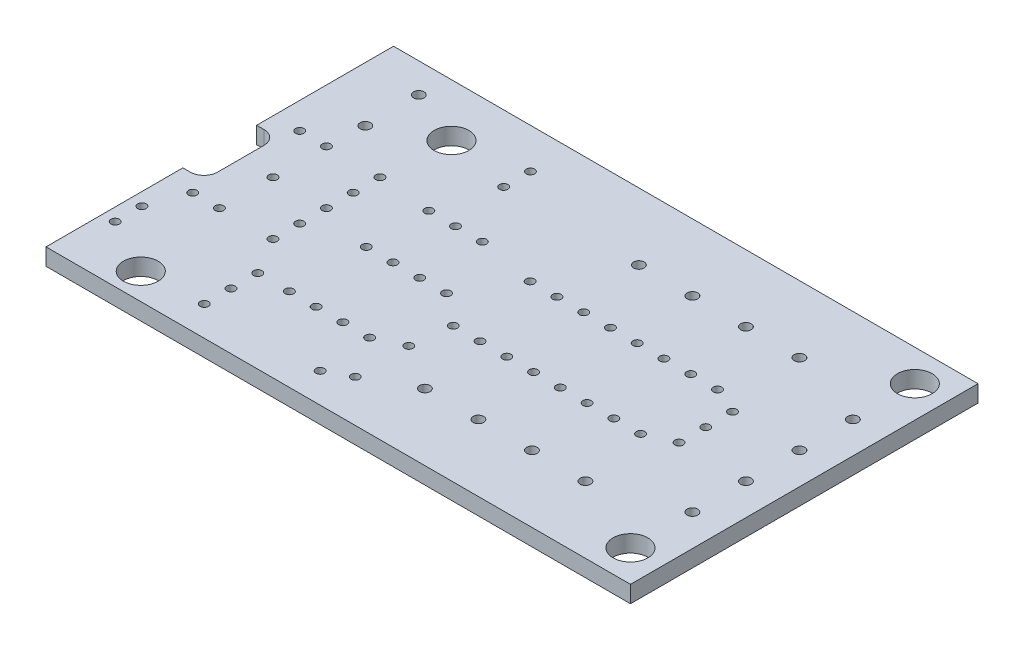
from build123d import *

# Parameters (mm, degrees)
ESQUISSE1_R      = 1.65
ESQUISSE1_R_2    = 0.5
ESQUISSE1_R_3    = 0.4
EXTRUSION1_DEPTH = 1.6


with BuildPart() as part:
    # Esquisse1 → Extrusion1 (new body)
    with BuildSketch(Plane(origin=(0, 0, 0), x_dir=(1, 0, 0), z_dir=(0, 1, 0))):
        with BuildLine():
            Line((0, 0), (55.5, 0))
            Line((55.5, 0), (55.5, 33))
            Line((55.5, 33), (0, 33))
            Line((0, 33), (0, 20))
            Line((0, 20), (0.7, 20))
            ThreePointArc((0.7, 20), (1.619238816, 19.619238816), (2, 18.7))
            Line((2, 18.7), (2, 14.3))
            ThreePointArc((2, 14.3), (1.619238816, 13.380761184), (0.7, 13))
            Line((0.7, 13), (0, 13))
            Line((0, 13), (0, 0))
        make_face()
        with Locations(Location((52.5, 3, 0), (0, 0, 270))):
            Circle(ESQUISSE1_R, mode=Mode.SUBTRACT)
        with Locations(Location((52.5, 8.88, 0), (0, 0, 270))):
            Circle(ESQUISSE1_R_2, mode=Mode.SUBTRACT)
        with Locations(Location((52.5, 13.96, 0), (0, 0, 270))):
            Circle(ESQUISSE1_R_2, mode=Mode.SUBTRACT)
        with Locations(Location((52.5, 30, 0), (0, 0, 90))):
            Circle(ESQUISSE1_R, mode=Mode.SUBTRACT)
        with Locations(Location((52.5, 24.12, 0), (0, 0, 90))):
            Circle(ESQUISSE1_R_2, mode=Mode.SUBTRACT)
        with Locations(Location((52.5, 19.04, 0), (0, 0, 90))):
            Circle(ESQUISSE1_R_2, mode=Mode.SUBTRACT)
        with Locations(Location((46.15, 13.96, 0), (0, 0, 270))):
            Circle(ESQUISSE1_R_3, mode=Mode.SUBTRACT)
        with Locations(Location((46.15, 16.5, 0), (0, 0, 270))):
            Circle(ESQUISSE1_R_3, mode=Mode.SUBTRACT)
        with Locations(Location((46.15, 19.04, 0), (0, 0, 90))):
            Circle(ESQUISSE1_R_3, mode=Mode.SUBTRACT)
        with Locations(Location((43.61, 12.85, 0), (0, 0, 270))):
            Circle(ESQUISSE1_R_3, mode=Mode.SUBTRACT)
        with Locations(Location((41.069, 12.85, 0), (0, 0, 270))):
            Circle(ESQUISSE1_R_3, mode=Mode.SUBTRACT)
        with Locations(Location((38.528, 12.85, 0), (0, 0, 270))):
            Circle(ESQUISSE1_R_3, mode=Mode.SUBTRACT)
        with Locations(Location((35.987, 12.85, 0), (0, 0, 270))):
            Circle(ESQUISSE1_R_3, mode=Mode.SUBTRACT)
        with Locations(Location((33.446, 12.85, 0), (0, 0, 270))):
            Circle(ESQUISSE1_R_3, mode=Mode.SUBTRACT)
        with Locations(Location((30.905, 12.85, 0), (0, 0, 270))):
            Circle(ESQUISSE1_R_3, mode=Mode.SUBTRACT)
        with Locations(Location((28.364, 12.85, 0), (0, 0, 270))):
            Circle(ESQUISSE1_R_3, mode=Mode.SUBTRACT)
        with Locations(Location((25.823, 12.85, 0), (0, 0, 270))):
            Circle(ESQUISSE1_R_3, mode=Mode.SUBTRACT)
        with Locations(Location((25.823, 20.15, 0), (0, 0, 90))):
            Circle(ESQUISSE1_R_3, mode=Mode.SUBTRACT)
        with Locations(Location((28.364, 20.15, 0), (0, 0, 90))):
            Circle(ESQUISSE1_R_3, mode=Mode.SUBTRACT)
        with Locations(Location((30.905, 20.15, 0), (0, 0, 90))):
            Circle(ESQUISSE1_R_3, mode=Mode.SUBTRACT)
        with Locations(Location((33.446, 20.15, 0), (0, 0, 90))):
            Circle(ESQUISSE1_R_3, mode=Mode.SUBTRACT)
        with Locations(Location((35.987, 20.15, 0), (0, 0, 90))):
            Circle(ESQUISSE1_R_3, mode=Mode.SUBTRACT)
        with Locations(Location((38.528, 20.15, 0), (0, 0, 90))):
            Circle(ESQUISSE1_R_3, mode=Mode.SUBTRACT)
        with Locations(Location((41.069, 20.15, 0), (0, 0, 90))):
            Circle(ESQUISSE1_R_3, mode=Mode.SUBTRACT)
        with Locations(Location((43.61, 20.15, 0), (0, 0, 90))):
            Circle(ESQUISSE1_R_3, mode=Mode.SUBTRACT)
        with Locations(Location((44.88, 6.34, 0), (0, 0, 270))):
            Circle(ESQUISSE1_R_2, mode=Mode.SUBTRACT)
        with Locations(Location((39.8, 6.34, 0), (0, 0, 270))):
            Circle(ESQUISSE1_R_2, mode=Mode.SUBTRACT)
        with Locations(Location((34.72, 6.34, 0), (0, 0, 270))):
            Circle(ESQUISSE1_R_2, mode=Mode.SUBTRACT)
        with Locations(Location((29.64, 6.34, 0), (0, 0, 270))):
            Circle(ESQUISSE1_R_2, mode=Mode.SUBTRACT)
        with Locations(Location((29.64, 26.66, 0), (0, 0, 90))):
            Circle(ESQUISSE1_R_2, mode=Mode.SUBTRACT)
        with Locations(Location((34.72, 26.66, 0), (0, 0, 90))):
            Circle(ESQUISSE1_R_2, mode=Mode.SUBTRACT)
        with Locations(Location((39.8, 26.66, 0), (0, 0, 90))):
            Circle(ESQUISSE1_R_2, mode=Mode.SUBTRACT)
        with Locations(Location((44.88, 26.66, 0), (0, 0, 90))):
            Circle(ESQUISSE1_R_2, mode=Mode.SUBTRACT)
        with Locations(Location((22.83, 7.9, 0), (0, 0, 270))):
            Circle(ESQUISSE1_R_3, mode=Mode.SUBTRACT)
        with Locations(Location((22.83, 15.2, 0), (0, 0, 270))):
            Circle(ESQUISSE1_R_3, mode=Mode.SUBTRACT)
        with Locations(Location((12.21, 5.36, 0), (0, 0, 270))):
            Circle(ESQUISSE1_R_3, mode=Mode.SUBTRACT)
        with Locations(Location((12.21, 7.9, 0), (0, 0, 270))):
            Circle(ESQUISSE1_R_3, mode=Mode.SUBTRACT)
        with Locations(Location((20.29, 21.14, 0), (0, 0, 270))):
            Circle(ESQUISSE1_R_3, mode=Mode.SUBTRACT)
        with Locations(Location((20.29, 15.2, 0), (0, 0, 270))):
            Circle(ESQUISSE1_R_3, mode=Mode.SUBTRACT)
        with Locations(Location((20.29, 7.9, 0), (0, 0, 270))):
            Circle(ESQUISSE1_R_3, mode=Mode.SUBTRACT)
        with Locations(Location((17.75, 21.14, 0), (0, 0, 270))):
            Circle(ESQUISSE1_R_3, mode=Mode.SUBTRACT)
        with Locations(Location((17.75, 15.2, 0), (0, 0, 270))):
            Circle(ESQUISSE1_R_3, mode=Mode.SUBTRACT)
        with Locations(Location((17.75, 7.9, 0), (0, 0, 270))):
            Circle(ESQUISSE1_R_3, mode=Mode.SUBTRACT)
        with Locations(Location((15.21, 21.14, 0), (0, 0, 270))):
            Circle(ESQUISSE1_R_3, mode=Mode.SUBTRACT)
        with Locations(Location((15.21, 15.2, 0), (0, 0, 270))):
            Circle(ESQUISSE1_R_3, mode=Mode.SUBTRACT)
        with Locations(Location((15.21, 7.9, 0), (0, 0, 270))):
            Circle(ESQUISSE1_R_3, mode=Mode.SUBTRACT)
        with Locations(Location((12.21, 2.82, 0), (0, 0, 270))):
            Circle(ESQUISSE1_R_3, mode=Mode.SUBTRACT)
        with Locations(Location((25.37, 4, 0), (0, 0, 270))):
            Circle(ESQUISSE1_R_3, mode=Mode.SUBTRACT)
        with Locations(Location((25.37, 9.08, 0), (0, 0, 270))):
            Circle(ESQUISSE1_R_3, mode=Mode.SUBTRACT)
        with Locations(Location((23.21, 2.82, 0), (0, 0, 270))):
            Circle(ESQUISSE1_R_3, mode=Mode.SUBTRACT)
        with Locations(Location((16.8, 26.66, 0), (0, 0, 270))):
            Circle(ESQUISSE1_R_3, mode=Mode.SUBTRACT)
        with Locations(Location((16.8, 29.2, 0), (0, 0, 270))):
            Circle(ESQUISSE1_R_3, mode=Mode.SUBTRACT)
        with Locations(Location((1.21, 5.36, 0), (0, 0, 270))):
            Circle(ESQUISSE1_R_3, mode=Mode.SUBTRACT)
        with Locations(Location((1.21, 7.9, 0), (0, 0, 270))):
            Circle(ESQUISSE1_R_3, mode=Mode.SUBTRACT)
        with Locations(Location((10.13, 16.5, 0), (0, 0, 270))):
            Circle(ESQUISSE1_R_3, mode=Mode.SUBTRACT)
        with Locations(Location((10.13, 13.96, 0), (0, 0, 270))):
            Circle(ESQUISSE1_R_3, mode=Mode.SUBTRACT)
        with Locations(Location((10.13, 11.42, 0), (0, 0, 270))):
            Circle(ESQUISSE1_R_3, mode=Mode.SUBTRACT)
        with Locations(Location((10.13, 19.04, 0), (0, 0, 270))):
            Circle(ESQUISSE1_R_3, mode=Mode.SUBTRACT)
        with Locations(Location((10.13, 21.58, 0), (0, 0, 270))):
            Circle(ESQUISSE1_R_3, mode=Mode.SUBTRACT)
        with Locations(Location((5.2, 30.2, 0), (0, 0, 270))):
            Circle(ESQUISSE1_R_2, mode=Mode.SUBTRACT)
        with Locations(Location((5.2, 25.12, 0), (0, 0, 270))):
            Circle(ESQUISSE1_R_2, mode=Mode.SUBTRACT)
        with Locations(Location((10.5, 28, 0), (0, 0, 270))):
            Circle(ESQUISSE1_R, mode=Mode.SUBTRACT)
        with Locations(Location((5.05, 11.42, 0), (0, 0, 270))):
            Circle(ESQUISSE1_R_3, mode=Mode.SUBTRACT)
        with Locations(Location((5.05, 16.5, 0), (0, 0, 270))):
            Circle(ESQUISSE1_R_3, mode=Mode.SUBTRACT)
        with Locations(Location((5.05, 21.58, 0), (0, 0, 270))):
            Circle(ESQUISSE1_R_3, mode=Mode.SUBTRACT)
        with Locations(Location((2.51, 11.42, 0), (0, 0, 270))):
            Circle(ESQUISSE1_R_3, mode=Mode.SUBTRACT)
        with Locations(Location((6.5, 2.5, 0), (0, 0, 270))):
            Circle(ESQUISSE1_R, mode=Mode.SUBTRACT)
        with Locations(Location((2.51, 21.58, 0), (0, 0, 270))):
            Circle(ESQUISSE1_R_3, mode=Mode.SUBTRACT)
    extrude(amount=EXTRUSION1_DEPTH)


solid = part.part
